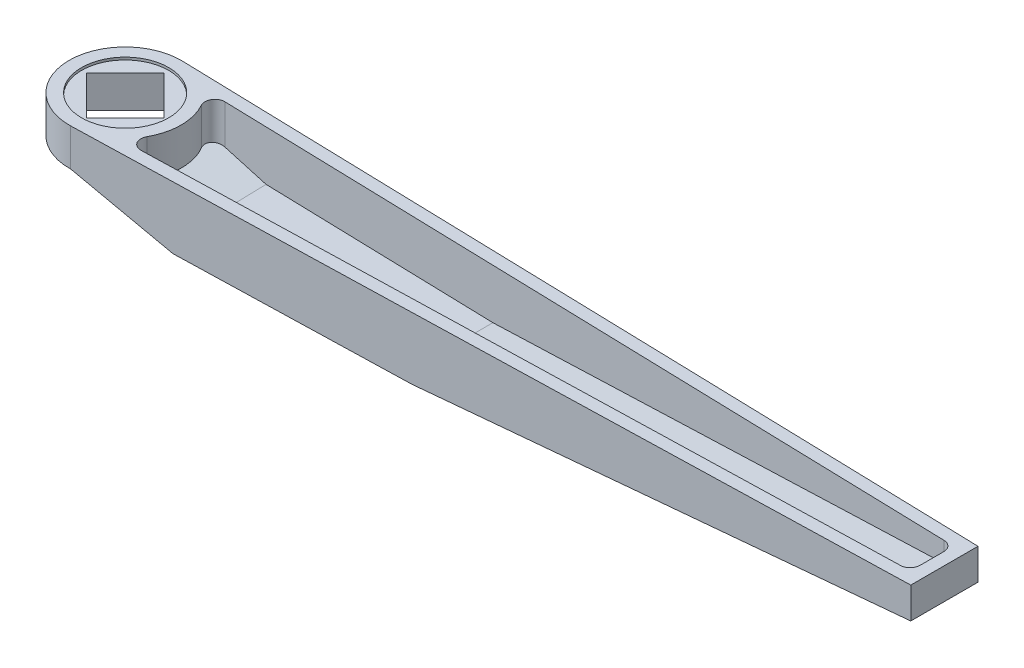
ISO-10303-21;
HEADER;
FILE_DESCRIPTION(('STEP AP214'),'2;1');
FILE_NAME('part.step','',(''),(''),'','','');
FILE_SCHEMA(('AUTOMOTIVE_DESIGN { 1 0 10303 214 1 1 1 1 }'));
ENDSEC;
DATA;
#1=APPLICATION_CONTEXT('core data for automotive mechanical design processes');
#2=APPLICATION_PROTOCOL_DEFINITION('international standard','automotive_design',2000,#1);
#3=PRODUCT_CONTEXT('',#1,'mechanical');
#4=PRODUCT('Part','Part','',(#3));
#5=PRODUCT_RELATED_PRODUCT_CATEGORY('part','',(#4));
#6=PRODUCT_DEFINITION_FORMATION('','',#4);
#7=PRODUCT_DEFINITION_CONTEXT('part definition',#1,'design');
#8=PRODUCT_DEFINITION('design','',#6,#7);
#9=PRODUCT_DEFINITION_SHAPE('','',#8);
#10=(LENGTH_UNIT() NAMED_UNIT(*) SI_UNIT(.MILLI.,.METRE.));
#11=(NAMED_UNIT(*) PLANE_ANGLE_UNIT() SI_UNIT($,.RADIAN.));
#12=(NAMED_UNIT(*) SI_UNIT($,.STERADIAN.) SOLID_ANGLE_UNIT());
#13=UNCERTAINTY_MEASURE_WITH_UNIT(LENGTH_MEASURE(1.E-05),#10,'distance_accuracy_value','');
#14=(GEOMETRIC_REPRESENTATION_CONTEXT(3) GLOBAL_UNCERTAINTY_ASSIGNED_CONTEXT((#13)) GLOBAL_UNIT_ASSIGNED_CONTEXT((#10,
#11,#12)) REPRESENTATION_CONTEXT('',''));
#15=CARTESIAN_POINT('',(0.,0.,0.));
#16=DIRECTION('',(0.,0.,1.));
#17=DIRECTION('',(1.,0.,0.));
#18=AXIS2_PLACEMENT_3D('',#15,#16,#17);
#19=CARTESIAN_POINT('',(0.615847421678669,25.,-22.4915702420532));
#20=DIRECTION('',(1.,0.,0.));
#21=DIRECTION('',(0.,0.,-1.));
#22=AXIS2_PLACEMENT_3D('',#19,#20,#21);
#23=PLANE('',#22);
#24=DIRECTION('',(0.,1.,0.));
#25=VECTOR('',#24,1.);
#26=CARTESIAN_POINT('',(0.615847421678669,0.,17.4891604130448));
#27=LINE('',#26,#25);
#28=CARTESIAN_POINT('',(0.615847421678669,9.96576976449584,17.4891604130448));
#29=VERTEX_POINT('',#28);
#30=CARTESIAN_POINT('',(0.615847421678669,10.,17.4891604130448));
#31=VERTEX_POINT('',#30);
#32=EDGE_CURVE('E229',#29,#31,#27,.T.);
#33=ORIENTED_EDGE('',*,*,#32,.F.);
#34=DIRECTION('',(0.,0.00684258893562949,0.999976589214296));
#35=VECTOR('',#34,1.);
#36=CARTESIAN_POINT('',(0.615847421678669,9.69290838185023,-22.3868276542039));
#37=LINE('',#36,#35);
#38=CARTESIAN_POINT('',(0.615847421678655,10.,22.4915702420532));
#39=VERTEX_POINT('',#38);
#40=EDGE_CURVE('E325',#29,#39,#37,.T.);
#41=ORIENTED_EDGE('',*,*,#40,.T.);
#42=DIRECTION('',(0.,0.,1.));
#43=VECTOR('',#42,1.);
#44=CARTESIAN_POINT('',(0.615847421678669,10.,-22.4915702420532));
#45=LINE('',#44,#43);
#46=EDGE_CURVE('E246',#31,#39,#45,.T.);
#47=ORIENTED_EDGE('',*,*,#46,.F.);
#48=EDGE_LOOP('',(#33,#41,#47));
#49=FACE_BOUND('',#48,.T.);
#50=ADVANCED_FACE('F61',(#49),#23,.F.);
#51=DIRECTION('',(0.,1.,0.));
#52=VECTOR('',#51,1.);
#53=CARTESIAN_POINT('',(0.615847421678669,0.,-17.4891604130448));
#54=LINE('',#53,#52);
#55=CARTESIAN_POINT('',(0.615847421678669,10.,-17.4891604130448));
#56=VERTEX_POINT('',#55);
#57=CARTESIAN_POINT('',(0.615847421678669,9.72642189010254,-17.4891604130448));
#58=VERTEX_POINT('',#57);
#59=EDGE_CURVE('E219',#56,#58,#54,.F.);
#60=ORIENTED_EDGE('',*,*,#59,.F.);
#61=CARTESIAN_POINT('',(0.615847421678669,10.,-22.4915702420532));
#62=VERTEX_POINT('',#61);
#63=EDGE_CURVE('E223',#62,#56,#45,.T.);
#64=ORIENTED_EDGE('',*,*,#63,.F.);
#65=DIRECTION('',(0.,-1.,0.));
#66=VECTOR('',#65,1.);
#67=CARTESIAN_POINT('',(0.615847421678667,25.,-22.4915702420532));
#68=LINE('',#67,#66);
#69=CARTESIAN_POINT('',(0.615847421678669,9.69219165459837,-22.4915702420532));
#70=VERTEX_POINT('',#69);
#71=EDGE_CURVE('E319',#62,#70,#68,.T.);
#72=ORIENTED_EDGE('',*,*,#71,.T.);
#73=EDGE_CURVE('E226',#70,#58,#37,.T.);
#74=ORIENTED_EDGE('',*,*,#73,.T.);
#75=EDGE_LOOP('',(#60,#64,#72,#74));
#76=FACE_BOUND('',#75,.T.);
#77=ADVANCED_FACE('F221',(#76),#23,.F.);
#78=CARTESIAN_POINT('',(11.98823269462,10.,437.826267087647));
#79=DIRECTION('',(0.242444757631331,0.970142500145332,-0.00663844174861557));
#80=DIRECTION('',(-0.970163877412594,0.242450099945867,0.));
#81=AXIS2_PLACEMENT_3D('',#78,#79,#80);
#82=PLANE('',#81);
#83=CARTESIAN_POINT('',(0.,10.,0.));
#84=DIRECTION('',(0.242444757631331,0.970142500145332,-0.00663844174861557));
#85=DIRECTION('',(-0.969779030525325,0.242535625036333,0.0265537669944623));
#86=AXIS2_PLACEMENT_3D('',#83,#84,#85);
#87=ELLIPSE('',#86,18.0385871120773,17.5);
#88=EDGE_CURVE('E454',#58,#29,#87,.F.);
#89=ORIENTED_EDGE('',*,*,#88,.F.);
#90=ORIENTED_EDGE('',*,*,#73,.F.);
#91=DIRECTION('',(0.969864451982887,-0.242193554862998,0.02655610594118));
#92=VECTOR('',#91,1.);
#93=CARTESIAN_POINT('',(-118.23205966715,39.3707689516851,-25.7457751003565));
#94=LINE('',#93,#92);
#95=CARTESIAN_POINT('',(39.4282433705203,0.,-21.4288381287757));
#96=VERTEX_POINT('',#95);
#97=EDGE_CURVE('E294',#70,#96,#94,.T.);
#98=ORIENTED_EDGE('',*,*,#97,.T.);
#99=DIRECTION('',(-0.027370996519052,0.,-0.999625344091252));
#100=VECTOR('',#99,1.);
#101=CARTESIAN_POINT('',(51.9732464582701,0.,436.731427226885));
#102=LINE('',#101,#100);
#103=CARTESIAN_POINT('',(40.6008611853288,0.,21.3967303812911));
#104=VERTEX_POINT('',#103);
#105=EDGE_CURVE('E291',#104,#96,#102,.T.);
#106=ORIENTED_EDGE('',*,*,#105,.F.);
#107=DIRECTION('',(0.969779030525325,-0.242535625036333,-0.0265537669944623));
#108=VECTOR('',#107,1.);
#109=CARTESIAN_POINT('',(-118.144121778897,39.7011200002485,25.7433672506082));
#110=LINE('',#109,#108);
#111=EDGE_CURVE('E296',#39,#104,#110,.T.);
#112=ORIENTED_EDGE('',*,*,#111,.F.);
#113=ORIENTED_EDGE('',*,*,#40,.F.);
#114=EDGE_LOOP('',(#89,#90,#98,#106,#112,#113));
#115=FACE_BOUND('',#114,.T.);
#116=ADVANCED_FACE('F460',(#115),#82,.F.);
#117=CARTESIAN_POINT('',(0.,11.,0.));
#118=DIRECTION('',(0.,-1.,0.));
#119=DIRECTION('',(0.,0.,-1.));
#120=AXIS2_PLACEMENT_3D('',#117,#118,#119);
#121=PLANE('',#120);
#122=CARTESIAN_POINT('',(0.,11.,0.));
#123=DIRECTION('',(0.,-1.,0.));
#124=DIRECTION('',(0.,0.,-1.));
#125=AXIS2_PLACEMENT_3D('',#122,#123,#124);
#126=CIRCLE('',#125,17.5);
#127=CARTESIAN_POINT('',(0.,11.,-17.5));
#128=VERTEX_POINT('',#127);
#129=EDGE_CURVE('E406',#128,#128,#126,.T.);
#130=ORIENTED_EDGE('',*,*,#129,.T.);
#131=EDGE_LOOP('',(#130));
#132=FACE_BOUND('',#131,.T.);
#133=DIRECTION('',(0.707106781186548,0.,0.707106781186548));
#134=VECTOR('',#133,1.);
#135=CARTESIAN_POINT('',(-7.77817459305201,11.,7.77817459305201));
#136=LINE('',#135,#134);
#137=CARTESIAN_POINT('',(-15.556349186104,11.,0.));
#138=VERTEX_POINT('',#137);
#139=CARTESIAN_POINT('',(0.,11.,15.556349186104));
#140=VERTEX_POINT('',#139);
#141=EDGE_CURVE('E424',#138,#140,#136,.T.);
#142=ORIENTED_EDGE('',*,*,#141,.T.);
#143=DIRECTION('',(0.707106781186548,0.,-0.707106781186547));
#144=VECTOR('',#143,1.);
#145=CARTESIAN_POINT('',(7.77817459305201,11.,7.77817459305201));
#146=LINE('',#145,#144);
#147=CARTESIAN_POINT('',(15.556349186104,11.,0.));
#148=VERTEX_POINT('',#147);
#149=EDGE_CURVE('E420',#140,#148,#146,.T.);
#150=ORIENTED_EDGE('',*,*,#149,.T.);
#151=DIRECTION('',(-0.707106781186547,0.,-0.707106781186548));
#152=VECTOR('',#151,1.);
#153=CARTESIAN_POINT('',(7.77817459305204,11.,-7.77817459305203));
#154=LINE('',#153,#152);
#155=CARTESIAN_POINT('',(0.,11.,-15.5563491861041));
#156=VERTEX_POINT('',#155);
#157=EDGE_CURVE('E430',#148,#156,#154,.T.);
#158=ORIENTED_EDGE('',*,*,#157,.T.);
#159=DIRECTION('',(-0.707106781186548,0.,0.707106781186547));
#160=VECTOR('',#159,1.);
#161=CARTESIAN_POINT('',(-7.77817459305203,11.,-7.77817459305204));
#162=LINE('',#161,#160);
#163=EDGE_CURVE('E427',#156,#138,#162,.T.);
#164=ORIENTED_EDGE('',*,*,#163,.T.);
#165=EDGE_LOOP('',(#142,#150,#158,#164));
#166=FACE_BOUND('',#165,.T.);
#167=ADVANCED_FACE('F535',(#132,#166),#121,.T.);
#168=CARTESIAN_POINT('',(0.,24.,0.));
#169=DIRECTION('',(0.,-1.,0.));
#170=DIRECTION('',(0.,0.,-1.));
#171=AXIS2_PLACEMENT_3D('',#168,#169,#170);
#172=PLANE('',#171);
#173=CARTESIAN_POINT('',(0.,24.,0.));
#174=DIRECTION('',(0.,-1.,0.));
#175=DIRECTION('',(0.,0.,-1.));
#176=AXIS2_PLACEMENT_3D('',#173,#174,#175);
#177=CIRCLE('',#176,17.5);
#178=CARTESIAN_POINT('',(0.,24.,-17.5));
#179=VERTEX_POINT('',#178);
#180=EDGE_CURVE('E411',#179,#179,#177,.T.);
#181=ORIENTED_EDGE('',*,*,#180,.F.);
#182=EDGE_LOOP('',(#181));
#183=FACE_BOUND('',#182,.T.);
#184=DIRECTION('',(-0.707106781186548,0.,0.707106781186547));
#185=VECTOR('',#184,1.);
#186=CARTESIAN_POINT('',(15.556349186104,24.,0.));
#187=LINE('',#186,#185);
#188=CARTESIAN_POINT('',(15.556349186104,24.,0.));
#189=VERTEX_POINT('',#188);
#190=CARTESIAN_POINT('',(0.,24.,15.556349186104));
#191=VERTEX_POINT('',#190);
#192=EDGE_CURVE('E451',#189,#191,#187,.T.);
#193=ORIENTED_EDGE('',*,*,#192,.T.);
#194=DIRECTION('',(-0.707106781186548,0.,-0.707106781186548));
#195=VECTOR('',#194,1.);
#196=CARTESIAN_POINT('',(-15.556349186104,24.,0.));
#197=LINE('',#196,#195);
#198=CARTESIAN_POINT('',(-15.556349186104,24.,0.));
#199=VERTEX_POINT('',#198);
#200=EDGE_CURVE('E448',#191,#199,#197,.T.);
#201=ORIENTED_EDGE('',*,*,#200,.T.);
#202=DIRECTION('',(0.707106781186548,0.,-0.707106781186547));
#203=VECTOR('',#202,1.);
#204=CARTESIAN_POINT('',(0.,24.,-15.5563491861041));
#205=LINE('',#204,#203);
#206=CARTESIAN_POINT('',(0.,24.,-15.5563491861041));
#207=VERTEX_POINT('',#206);
#208=EDGE_CURVE('E445',#199,#207,#205,.T.);
#209=ORIENTED_EDGE('',*,*,#208,.T.);
#210=DIRECTION('',(0.707106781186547,0.,0.707106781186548));
#211=VECTOR('',#210,1.);
#212=CARTESIAN_POINT('',(0.,24.,-15.5563491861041));
#213=LINE('',#212,#211);
#214=EDGE_CURVE('E442',#207,#189,#213,.T.);
#215=ORIENTED_EDGE('',*,*,#214,.T.);
#216=EDGE_LOOP('',(#193,#201,#209,#215));
#217=FACE_BOUND('',#216,.T.);
#218=ADVANCED_FACE('F631',(#183,#217),#172,.F.);
#219=CARTESIAN_POINT('',(-122.525664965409,25.,0.));
#220=DIRECTION('',(0.,1.,0.));
#221=DIRECTION('',(0.,0.,1.));
#222=AXIS2_PLACEMENT_3D('',#219,#220,#221);
#223=PLANE('',#222);
#224=CARTESIAN_POINT('',(0.,25.,0.));
#225=DIRECTION('',(0.,1.,0.));
#226=DIRECTION('',(0.,0.,1.));
#227=AXIS2_PLACEMENT_3D('',#224,#225,#226);
#228=CIRCLE('',#227,22.5);
#229=CARTESIAN_POINT('',(0.615847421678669,25.,-22.4915702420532));
#230=VERTEX_POINT('',#229);
#231=CARTESIAN_POINT('',(0.615847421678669,25.,22.4915702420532));
#232=VERTEX_POINT('',#231);
#233=EDGE_CURVE('E253',#230,#232,#228,.T.);
#234=ORIENTED_EDGE('',*,*,#233,.T.);
#235=DIRECTION('',(0.999625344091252,0.,-0.027370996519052));
#236=VECTOR('',#235,1.);
#237=CARTESIAN_POINT('',(-121.818024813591,25.,25.8439633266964));
#238=LINE('',#237,#236);
#239=CARTESIAN_POINT('',(329.,25.,13.5));
#240=VERTEX_POINT('',#239);
#241=EDGE_CURVE('E307',#232,#240,#238,.T.);
#242=ORIENTED_EDGE('',*,*,#241,.T.);
#243=DIRECTION('',(0.,0.,1.));
#244=VECTOR('',#243,1.);
#245=CARTESIAN_POINT('',(329.,25.,0.));
#246=LINE('',#245,#244);
#247=CARTESIAN_POINT('',(329.,25.,-13.5));
#248=VERTEX_POINT('',#247);
#249=EDGE_CURVE('E300',#248,#240,#246,.T.);
#250=ORIENTED_EDGE('',*,*,#249,.F.);
#251=DIRECTION('',(0.999625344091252,0.,0.027370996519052));
#252=VECTOR('',#251,1.);
#253=CARTESIAN_POINT('',(-121.818024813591,25.,-25.8439633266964));
#254=LINE('',#253,#252);
#255=EDGE_CURVE('E303',#230,#248,#254,.T.);
#256=ORIENTED_EDGE('',*,*,#255,.F.);
#257=EDGE_LOOP('',(#234,#242,#250,#256));
#258=FACE_BOUND('',#257,.T.);
#259=DIRECTION('',(0.999625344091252,0.,-0.027370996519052));
#260=VECTOR('',#259,1.);
#261=CARTESIAN_POINT('',(-121.954879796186,25.,20.8458366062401));
#262=LINE('',#261,#260);
#263=CARTESIAN_POINT('',(23.2739574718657,25.,16.869288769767));
#264=VERTEX_POINT('',#263);
#265=CARTESIAN_POINT('',(320.109483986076,25.,8.74155950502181));
#266=VERTEX_POINT('',#265);
#267=EDGE_CURVE('E277',#264,#266,#262,.T.);
#268=ORIENTED_EDGE('',*,*,#267,.F.);
#269=CARTESIAN_POINT('',(23.1644734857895,25.,12.870787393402));
#270=DIRECTION('',(0.,1.,0.));
#271=DIRECTION('',(0.,0.,1.));
#272=AXIS2_PLACEMENT_3D('',#269,#270,#271);
#273=CIRCLE('',#272,4.);
#274=CARTESIAN_POINT('',(19.6679491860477,25.,10.9280270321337));
#275=VERTEX_POINT('',#274);
#276=EDGE_CURVE('E362',#264,#275,#273,.F.);
#277=ORIENTED_EDGE('',*,*,#276,.T.);
#278=CARTESIAN_POINT('',(19.6679491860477,25.,-10.9280270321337));
#279=VERTEX_POINT('',#278);
#280=EDGE_CURVE('E398',#275,#279,#228,.T.);
#281=ORIENTED_EDGE('',*,*,#280,.T.);
#282=CARTESIAN_POINT('',(23.1644734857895,25.,-12.870787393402));
#283=DIRECTION('',(0.,1.,0.));
#284=DIRECTION('',(0.,0.,1.));
#285=AXIS2_PLACEMENT_3D('',#282,#283,#284);
#286=CIRCLE('',#285,4.);
#287=CARTESIAN_POINT('',(23.2739574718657,25.,-16.869288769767));
#288=VERTEX_POINT('',#287);
#289=EDGE_CURVE('E360',#279,#288,#286,.F.);
#290=ORIENTED_EDGE('',*,*,#289,.T.);
#291=DIRECTION('',(0.999625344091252,0.,0.027370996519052));
#292=VECTOR('',#291,1.);
#293=CARTESIAN_POINT('',(-121.954879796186,25.,-20.8458366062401));
#294=LINE('',#293,#292);
#295=CARTESIAN_POINT('',(320.109483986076,25.,-8.74155950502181));
#296=VERTEX_POINT('',#295);
#297=EDGE_CURVE('E281',#288,#296,#294,.T.);
#298=ORIENTED_EDGE('',*,*,#297,.T.);
#299=CARTESIAN_POINT('',(320.,25.,-4.7430581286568));
#300=DIRECTION('',(0.,1.,0.));
#301=DIRECTION('',(0.,0.,1.));
#302=AXIS2_PLACEMENT_3D('',#299,#300,#301);
#303=CIRCLE('',#302,4.);
#304=CARTESIAN_POINT('',(324.,25.,-4.7430581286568));
#305=VERTEX_POINT('',#304);
#306=EDGE_CURVE('E12',#296,#305,#303,.F.);
#307=ORIENTED_EDGE('',*,*,#306,.T.);
#308=DIRECTION('',(0.,0.,1.));
#309=VECTOR('',#308,1.);
#310=CARTESIAN_POINT('',(324.,25.,0.));
#311=LINE('',#310,#309);
#312=CARTESIAN_POINT('',(324.,25.,4.7430581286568));
#313=VERTEX_POINT('',#312);
#314=EDGE_CURVE('E265',#305,#313,#311,.T.);
#315=ORIENTED_EDGE('',*,*,#314,.T.);
#316=CARTESIAN_POINT('',(320.,25.,4.7430581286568));
#317=DIRECTION('',(0.,1.,0.));
#318=DIRECTION('',(0.,0.,1.));
#319=AXIS2_PLACEMENT_3D('',#316,#317,#318);
#320=CIRCLE('',#319,4.);
#321=EDGE_CURVE('E69',#313,#266,#320,.F.);
#322=ORIENTED_EDGE('',*,*,#321,.T.);
#323=EDGE_LOOP('',(#268,#277,#281,#290,#298,#307,#315,#322));
#324=FACE_BOUND('',#323,.T.);
#325=CARTESIAN_POINT('',(0.,25.,0.));
#326=DIRECTION('',(0.,-1.,0.));
#327=DIRECTION('',(0.,0.,-1.));
#328=AXIS2_PLACEMENT_3D('',#325,#326,#327);
#329=CIRCLE('',#328,17.5);
#330=CARTESIAN_POINT('',(0.,25.,-17.5));
#331=VERTEX_POINT('',#330);
#332=EDGE_CURVE('E416',#331,#331,#329,.T.);
#333=ORIENTED_EDGE('',*,*,#332,.T.);
#334=EDGE_LOOP('',(#333));
#335=FACE_BOUND('',#334,.T.);
#336=ADVANCED_FACE('F365',(#258,#324,#335),#223,.T.);
#337=CARTESIAN_POINT('',(-122.525664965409,0.,0.));
#338=DIRECTION('',(0.,1.,0.));
#339=DIRECTION('',(0.,0.,1.));
#340=AXIS2_PLACEMENT_3D('',#337,#338,#339);
#341=PLANE('',#340);
#342=DIRECTION('',(0.999625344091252,0.,0.027370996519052));
#343=VECTOR('',#342,1.);
#344=CARTESIAN_POINT('',(-121.818024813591,0.,-25.8439633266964));
#345=LINE('',#344,#343);
#346=CARTESIAN_POINT('',(134.,0.,-18.8393447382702));
#347=VERTEX_POINT('',#346);
#348=EDGE_CURVE('E299',#96,#347,#345,.T.);
#349=ORIENTED_EDGE('',*,*,#348,.T.);
#350=DIRECTION('',(0.,0.,1.));
#351=VECTOR('',#350,1.);
#352=CARTESIAN_POINT('',(134.,0.,-22.4915702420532));
#353=LINE('',#352,#351);
#354=CARTESIAN_POINT('',(134.,0.,18.8393447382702));
#355=VERTEX_POINT('',#354);
#356=EDGE_CURVE('E284',#347,#355,#353,.T.);
#357=ORIENTED_EDGE('',*,*,#356,.T.);
#358=DIRECTION('',(0.999625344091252,0.,-0.027370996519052));
#359=VECTOR('',#358,1.);
#360=CARTESIAN_POINT('',(-121.818024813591,0.,25.8439633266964));
#361=LINE('',#360,#359);
#362=EDGE_CURVE('E304',#104,#355,#361,.T.);
#363=ORIENTED_EDGE('',*,*,#362,.F.);
#364=ORIENTED_EDGE('',*,*,#105,.T.);
#365=EDGE_LOOP('',(#349,#357,#363,#364));
#366=FACE_BOUND('',#365,.T.);
#367=ADVANCED_FACE('F479',(#366),#341,.F.);
#368=CARTESIAN_POINT('',(-121.818024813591,25.,25.8439633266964));
#369=DIRECTION('',(-0.027370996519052,0.,-0.999625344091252));
#370=DIRECTION('',(-0.999625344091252,0.,0.027370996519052));
#371=AXIS2_PLACEMENT_3D('',#368,#369,#370);
#372=PLANE('',#371);
#373=ORIENTED_EDGE('',*,*,#362,.T.);
#374=DIRECTION('',(0.997579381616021,0.0639473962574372,-0.027314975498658));
#375=VECTOR('',#374,1.);
#376=CARTESIAN_POINT('',(-119.177100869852,-16.229301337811,25.7716515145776));
#377=LINE('',#376,#375);
#378=CARTESIAN_POINT('',(329.,12.5,13.5));
#379=VERTEX_POINT('',#378);
#380=EDGE_CURVE('E287',#355,#379,#377,.T.);
#381=ORIENTED_EDGE('',*,*,#380,.T.);
#382=DIRECTION('',(0.,-1.,0.));
#383=VECTOR('',#382,1.);
#384=CARTESIAN_POINT('',(329.,25.,13.5));
#385=LINE('',#384,#383);
#386=EDGE_CURVE('E309',#240,#379,#385,.T.);
#387=ORIENTED_EDGE('',*,*,#386,.F.);
#388=ORIENTED_EDGE('',*,*,#241,.F.);
#389=DIRECTION('',(0.,-1.,0.));
#390=VECTOR('',#389,1.);
#391=CARTESIAN_POINT('',(0.615847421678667,25.,22.4915702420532));
#392=LINE('',#391,#390);
#393=EDGE_CURVE('E316',#232,#39,#392,.T.);
#394=ORIENTED_EDGE('',*,*,#393,.T.);
#395=ORIENTED_EDGE('',*,*,#111,.T.);
#396=EDGE_LOOP('',(#373,#381,#387,#388,#394,#395));
#397=FACE_BOUND('',#396,.T.);
#398=ADVANCED_FACE('F463',(#397),#372,.F.);
#399=CARTESIAN_POINT('',(329.,25.,0.));
#400=DIRECTION('',(1.,0.,0.));
#401=DIRECTION('',(0.,0.,-1.));
#402=AXIS2_PLACEMENT_3D('',#399,#400,#401);
#403=PLANE('',#402);
#404=DIRECTION('',(0.,0.,1.));
#405=VECTOR('',#404,1.);
#406=CARTESIAN_POINT('',(329.,12.5,-22.4915702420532));
#407=LINE('',#406,#405);
#408=CARTESIAN_POINT('',(329.,12.5,-13.5));
#409=VERTEX_POINT('',#408);
#410=EDGE_CURVE('E276',#409,#379,#407,.T.);
#411=ORIENTED_EDGE('',*,*,#410,.F.);
#412=DIRECTION('',(0.,-1.,0.));
#413=VECTOR('',#412,1.);
#414=CARTESIAN_POINT('',(329.,25.,-13.5));
#415=LINE('',#414,#413);
#416=EDGE_CURVE('E322',#248,#409,#415,.T.);
#417=ORIENTED_EDGE('',*,*,#416,.F.);
#418=ORIENTED_EDGE('',*,*,#249,.T.);
#419=ORIENTED_EDGE('',*,*,#386,.T.);
#420=EDGE_LOOP('',(#411,#417,#418,#419));
#421=FACE_BOUND('',#420,.T.);
#422=ADVANCED_FACE('F475',(#421),#403,.T.);
#423=CARTESIAN_POINT('',(-121.818024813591,25.,-25.8439633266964));
#424=DIRECTION('',(0.027370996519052,0.,-0.999625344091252));
#425=DIRECTION('',(-0.999625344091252,0.,-0.027370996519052));
#426=AXIS2_PLACEMENT_3D('',#423,#424,#425);
#427=PLANE('',#426);
#428=DIRECTION('',(0.997579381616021,0.0639473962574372,0.027314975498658));
#429=VECTOR('',#428,1.);
#430=CARTESIAN_POINT('',(-119.177100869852,-16.229301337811,-25.7716515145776));
#431=LINE('',#430,#429);
#432=EDGE_CURVE('E327',#347,#409,#431,.T.);
#433=ORIENTED_EDGE('',*,*,#432,.F.);
#434=ORIENTED_EDGE('',*,*,#348,.F.);
#435=ORIENTED_EDGE('',*,*,#97,.F.);
#436=ORIENTED_EDGE('',*,*,#71,.F.);
#437=EDGE_CURVE('E320',#230,#62,#68,.T.);
#438=ORIENTED_EDGE('',*,*,#437,.F.);
#439=ORIENTED_EDGE('',*,*,#255,.T.);
#440=ORIENTED_EDGE('',*,*,#416,.T.);
#441=EDGE_LOOP('',(#433,#434,#435,#436,#438,#439,#440));
#442=FACE_BOUND('',#441,.T.);
#443=ADVANCED_FACE('F470',(#442),#427,.T.);
#444=CARTESIAN_POINT('',(329.,12.5,-22.4915702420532));
#445=DIRECTION('',(-0.063971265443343,0.997951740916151,0.));
#446=DIRECTION('',(-0.997951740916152,-0.063971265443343,0.));
#447=AXIS2_PLACEMENT_3D('',#444,#445,#446);
#448=PLANE('',#447);
#449=ORIENTED_EDGE('',*,*,#356,.F.);
#450=ORIENTED_EDGE('',*,*,#432,.T.);
#451=ORIENTED_EDGE('',*,*,#410,.T.);
#452=ORIENTED_EDGE('',*,*,#380,.F.);
#453=EDGE_LOOP('',(#449,#450,#451,#452));
#454=FACE_BOUND('',#453,.T.);
#455=ADVANCED_FACE('F480',(#454),#448,.F.);
#456=CARTESIAN_POINT('',(-122.525664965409,5.,0.));
#457=DIRECTION('',(0.,1.,0.));
#458=DIRECTION('',(0.,0.,1.));
#459=AXIS2_PLACEMENT_3D('',#456,#457,#458);
#460=PLANE('',#459);
#461=DIRECTION('',(0.999625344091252,0.,0.027370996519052));
#462=VECTOR('',#461,1.);
#463=CARTESIAN_POINT('',(-121.954879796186,5.,-20.8458366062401));
#464=LINE('',#463,#462);
#465=CARTESIAN_POINT('',(40.1815245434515,5.,-16.4063383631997));
#466=VERTEX_POINT('',#465);
#467=CARTESIAN_POINT('',(133.839907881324,5.,-13.841854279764));
#468=VERTEX_POINT('',#467);
#469=EDGE_CURVE('E255',#466,#468,#464,.T.);
#470=ORIENTED_EDGE('',*,*,#469,.F.);
#471=DIRECTION('',(-0.027370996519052,0.,-0.999625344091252));
#472=VECTOR('',#471,1.);
#473=CARTESIAN_POINT('',(40.5085185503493,5.,-4.46408056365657));
#474=LINE('',#473,#472);
#475=CARTESIAN_POINT('',(41.0793037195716,5.,16.3817560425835));
#476=VERTEX_POINT('',#475);
#477=EDGE_CURVE('E266',#476,#466,#474,.T.);
#478=ORIENTED_EDGE('',*,*,#477,.F.);
#479=DIRECTION('',(0.999625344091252,0.,-0.027370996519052));
#480=VECTOR('',#479,1.);
#481=CARTESIAN_POINT('',(-121.954879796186,5.,20.8458366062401));
#482=LINE('',#481,#480);
#483=CARTESIAN_POINT('',(133.839907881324,5.,13.841854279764));
#484=VERTEX_POINT('',#483);
#485=EDGE_CURVE('E258',#476,#484,#482,.T.);
#486=ORIENTED_EDGE('',*,*,#485,.T.);
#487=DIRECTION('',(0.,0.,1.));
#488=VECTOR('',#487,1.);
#489=CARTESIAN_POINT('',(133.839907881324,5.,0.));
#490=LINE('',#489,#488);
#491=EDGE_CURVE('E248',#468,#484,#490,.T.);
#492=ORIENTED_EDGE('',*,*,#491,.F.);
#493=EDGE_LOOP('',(#470,#478,#486,#492));
#494=FACE_BOUND('',#493,.T.);
#495=ADVANCED_FACE('F390',(#494),#460,.T.);
#496=CARTESIAN_POINT('',(-121.954879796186,25.,20.8458366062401));
#497=DIRECTION('',(-0.027370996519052,0.,-0.999625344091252));
#498=DIRECTION('',(-0.999625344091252,0.,0.027370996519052));
#499=AXIS2_PLACEMENT_3D('',#496,#497,#498);
#500=PLANE('',#499);
#501=DIRECTION('',(0.969779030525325,-0.242535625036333,-0.0265537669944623));
#502=VECTOR('',#501,1.);
#503=CARTESIAN_POINT('',(-117.068752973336,44.5518325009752,20.7120483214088));
#504=LINE('',#503,#502);
#505=CARTESIAN_POINT('',(23.2739574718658,9.45300490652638,16.869288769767));
#506=VERTEX_POINT('',#505);
#507=EDGE_CURVE('E259',#506,#476,#504,.T.);
#508=ORIENTED_EDGE('',*,*,#507,.F.);
#509=DIRECTION('',(0.,-1.,0.));
#510=VECTOR('',#509,1.);
#511=CARTESIAN_POINT('',(23.2739574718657,25.,16.869288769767));
#512=LINE('',#511,#510);
#513=EDGE_CURVE('E350',#506,#264,#512,.F.);
#514=ORIENTED_EDGE('',*,*,#513,.T.);
#515=ORIENTED_EDGE('',*,*,#267,.T.);
#516=DIRECTION('',(0.,-1.,0.));
#517=VECTOR('',#516,1.);
#518=CARTESIAN_POINT('',(320.109483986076,25.,8.74155950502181));
#519=LINE('',#518,#517);
#520=CARTESIAN_POINT('',(320.109483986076,16.9403574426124,8.74155950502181));
#521=VERTEX_POINT('',#520);
#522=EDGE_CURVE('E347',#266,#521,#519,.T.);
#523=ORIENTED_EDGE('',*,*,#522,.T.);
#524=DIRECTION('',(0.997579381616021,0.0639473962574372,-0.027314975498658));
#525=VECTOR('',#524,1.);
#526=CARTESIAN_POINT('',(-119.633013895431,-11.2482642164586,20.7822610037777));
#527=LINE('',#526,#525);
#528=EDGE_CURVE('E262',#484,#521,#527,.T.);
#529=ORIENTED_EDGE('',*,*,#528,.F.);
#530=ORIENTED_EDGE('',*,*,#485,.F.);
#531=EDGE_LOOP('',(#508,#514,#515,#523,#529,#530));
#532=FACE_BOUND('',#531,.T.);
#533=ADVANCED_FACE('F372',(#532),#500,.T.);
#534=CARTESIAN_POINT('',(324.,25.,0.));
#535=DIRECTION('',(1.,0.,0.));
#536=DIRECTION('',(0.,0.,-1.));
#537=AXIS2_PLACEMENT_3D('',#534,#535,#536);
#538=PLANE('',#537);
#539=DIRECTION('',(0.,0.,1.));
#540=VECTOR('',#539,1.);
#541=CARTESIAN_POINT('',(324.,17.189749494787,0.));
#542=LINE('',#541,#540);
#543=CARTESIAN_POINT('',(324.,17.189749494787,-4.7430581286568));
#544=VERTEX_POINT('',#543);
#545=CARTESIAN_POINT('',(324.,17.189749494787,4.7430581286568));
#546=VERTEX_POINT('',#545);
#547=EDGE_CURVE('E245',#544,#546,#542,.T.);
#548=ORIENTED_EDGE('',*,*,#547,.T.);
#549=DIRECTION('',(0.,-1.,0.));
#550=VECTOR('',#549,1.);
#551=CARTESIAN_POINT('',(324.,25.,4.7430581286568));
#552=LINE('',#551,#550);
#553=EDGE_CURVE('E76',#546,#313,#552,.F.);
#554=ORIENTED_EDGE('',*,*,#553,.T.);
#555=ORIENTED_EDGE('',*,*,#314,.F.);
#556=DIRECTION('',(0.,-1.,0.));
#557=VECTOR('',#556,1.);
#558=CARTESIAN_POINT('',(324.,17.189749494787,-4.7430581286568));
#559=LINE('',#558,#557);
#560=EDGE_CURVE('E356',#305,#544,#559,.T.);
#561=ORIENTED_EDGE('',*,*,#560,.T.);
#562=EDGE_LOOP('',(#548,#554,#555,#561));
#563=FACE_BOUND('',#562,.T.);
#564=ADVANCED_FACE('F378',(#563),#538,.F.);
#565=CARTESIAN_POINT('',(-121.954879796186,25.,-20.8458366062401));
#566=DIRECTION('',(0.027370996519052,0.,-0.999625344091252));
#567=DIRECTION('',(-0.999625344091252,0.,-0.027370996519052));
#568=AXIS2_PLACEMENT_3D('',#565,#566,#567);
#569=PLANE('',#568);
#570=ORIENTED_EDGE('',*,*,#297,.F.);
#571=DIRECTION('',(0.,1.,0.));
#572=VECTOR('',#571,1.);
#573=CARTESIAN_POINT('',(23.2739574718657,25.,-16.869288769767));
#574=LINE('',#573,#572);
#575=CARTESIAN_POINT('',(23.2739574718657,9.22214028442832,-16.869288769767));
#576=VERTEX_POINT('',#575);
#577=EDGE_CURVE('E335',#288,#576,#574,.F.);
#578=ORIENTED_EDGE('',*,*,#577,.T.);
#579=DIRECTION('',(0.969864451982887,-0.242193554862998,0.02655610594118));
#580=VECTOR('',#579,1.);
#581=CARTESIAN_POINT('',(-117.142226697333,44.2867255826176,-20.7140601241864));
#582=LINE('',#581,#580);
#583=EDGE_CURVE('E269',#576,#466,#582,.T.);
#584=ORIENTED_EDGE('',*,*,#583,.T.);
#585=ORIENTED_EDGE('',*,*,#469,.T.);
#586=DIRECTION('',(0.997579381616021,0.0639473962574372,0.027314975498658));
#587=VECTOR('',#586,1.);
#588=CARTESIAN_POINT('',(-119.633013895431,-11.2482642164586,-20.7822610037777));
#589=LINE('',#588,#587);
#590=CARTESIAN_POINT('',(320.109483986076,16.9403574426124,-8.74155950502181));
#591=VERTEX_POINT('',#590);
#592=EDGE_CURVE('E273',#468,#591,#589,.T.);
#593=ORIENTED_EDGE('',*,*,#592,.T.);
#594=DIRECTION('',(0.,-1.,0.));
#595=VECTOR('',#594,1.);
#596=CARTESIAN_POINT('',(320.109483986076,25.,-8.74155950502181));
#597=LINE('',#596,#595);
#598=EDGE_CURVE('E238',#591,#296,#597,.F.);
#599=ORIENTED_EDGE('',*,*,#598,.T.);
#600=EDGE_LOOP('',(#570,#578,#584,#585,#593,#599));
#601=FACE_BOUND('',#600,.T.);
#602=ADVANCED_FACE('F385',(#601),#569,.F.);
#603=CARTESIAN_POINT('',(13.2004564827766,14.8507125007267,437.793074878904));
#604=DIRECTION('',(0.242444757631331,0.970142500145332,-0.00663844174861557));
#605=DIRECTION('',(-0.970163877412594,0.242450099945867,0.));
#606=AXIS2_PLACEMENT_3D('',#603,#604,#605);
#607=PLANE('',#606);
#608=ORIENTED_EDGE('',*,*,#583,.F.);
#609=CARTESIAN_POINT('',(23.1644734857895,9.27686176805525,-12.870787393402));
#610=DIRECTION('',(0.242444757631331,0.970142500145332,-0.00663844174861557));
#611=DIRECTION('',(-0.969779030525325,0.242535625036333,0.0265537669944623));
#612=AXIS2_PLACEMENT_3D('',#609,#610,#611);
#613=ELLIPSE('',#612,4.12310562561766,4.);
#614=CARTESIAN_POINT('',(19.6679491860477,10.1639591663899,-10.9280270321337));
#615=VERTEX_POINT('',#614);
#616=EDGE_CURVE('E340',#576,#615,#613,.T.);
#617=ORIENTED_EDGE('',*,*,#616,.T.);
#618=CARTESIAN_POINT('',(0.,15.1538820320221,0.));
#619=DIRECTION('',(0.242444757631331,0.970142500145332,-0.00663844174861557));
#620=DIRECTION('',(-0.969779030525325,0.242535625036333,0.0265537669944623));
#621=AXIS2_PLACEMENT_3D('',#618,#619,#620);
#622=ELLIPSE('',#621,23.1924691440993,22.5);
#623=CARTESIAN_POINT('',(20.3610855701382,10.,-9.5747686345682));
#624=VERTEX_POINT('',#623);
#625=EDGE_CURVE('E239',#624,#615,#622,.T.);
#626=ORIENTED_EDGE('',*,*,#625,.F.);
#627=DIRECTION('',(0.027370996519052,0.,0.999625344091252));
#628=VECTOR('',#627,1.);
#629=CARTESIAN_POINT('',(32.5960370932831,10.,437.261999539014));
#630=LINE('',#629,#628);
#631=CARTESIAN_POINT('',(20.8545232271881,10.,8.44623353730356));
#632=VERTEX_POINT('',#631);
#633=EDGE_CURVE('E329',#624,#632,#630,.T.);
#634=ORIENTED_EDGE('',*,*,#633,.T.);
#635=CARTESIAN_POINT('',(19.6679491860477,10.3135146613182,10.9280270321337));
#636=VERTEX_POINT('',#635);
#637=EDGE_CURVE('E332',#636,#632,#622,.T.);
#638=ORIENTED_EDGE('',*,*,#637,.F.);
#639=CARTESIAN_POINT('',(23.1644734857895,9.45300490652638,12.870787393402));
#640=DIRECTION('',(0.242444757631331,0.970142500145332,-0.00663844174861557));
#641=DIRECTION('',(-0.969779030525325,0.242535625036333,0.0265537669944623));
#642=AXIS2_PLACEMENT_3D('',#639,#640,#641);
#643=ELLIPSE('',#642,4.12310562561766,4.);
#644=EDGE_CURVE('E338',#636,#506,#643,.T.);
#645=ORIENTED_EDGE('',*,*,#644,.T.);
#646=ORIENTED_EDGE('',*,*,#507,.T.);
#647=ORIENTED_EDGE('',*,*,#477,.T.);
#648=EDGE_LOOP('',(#608,#617,#626,#634,#638,#645,#646,#647));
#649=FACE_BOUND('',#648,.T.);
#650=ADVANCED_FACE('F676',(#649),#607,.T.);
#651=CARTESIAN_POINT('',(328.680143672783,17.4897587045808,-22.4915702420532));
#652=DIRECTION('',(-0.063971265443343,0.997951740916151,0.));
#653=DIRECTION('',(-0.997951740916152,-0.063971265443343,0.));
#654=AXIS2_PLACEMENT_3D('',#651,#652,#653);
#655=PLANE('',#654);
#656=ORIENTED_EDGE('',*,*,#528,.T.);
#657=CARTESIAN_POINT('',(320.,16.9333392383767,4.7430581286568));
#658=DIRECTION('',(-0.063971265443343,0.997951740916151,0.));
#659=DIRECTION('',(-0.997951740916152,-0.063971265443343,0.));
#660=AXIS2_PLACEMENT_3D('',#657,#658,#659);
#661=ELLIPSE('',#660,4.00820985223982,4.);
#662=EDGE_CURVE('E354',#521,#546,#661,.T.);
#663=ORIENTED_EDGE('',*,*,#662,.T.);
#664=ORIENTED_EDGE('',*,*,#547,.F.);
#665=CARTESIAN_POINT('',(320.,16.9333392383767,-4.7430581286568));
#666=DIRECTION('',(-0.063971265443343,0.997951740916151,0.));
#667=DIRECTION('',(0.997951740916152,0.063971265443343,0.));
#668=AXIS2_PLACEMENT_3D('',#665,#666,#667);
#669=ELLIPSE('',#668,4.00820985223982,4.);
#670=EDGE_CURVE('E352',#544,#591,#669,.T.);
#671=ORIENTED_EDGE('',*,*,#670,.T.);
#672=ORIENTED_EDGE('',*,*,#592,.F.);
#673=ORIENTED_EDGE('',*,*,#491,.T.);
#674=EDGE_LOOP('',(#656,#663,#664,#671,#672,#673));
#675=FACE_BOUND('',#674,.T.);
#676=ADVANCED_FACE('F377',(#675),#655,.T.);
#677=CARTESIAN_POINT('',(0.,10.,0.));
#678=DIRECTION('',(0.,1.,0.));
#679=DIRECTION('',(0.,0.,1.));
#680=AXIS2_PLACEMENT_3D('',#677,#678,#679);
#681=CYLINDRICAL_SURFACE('',#680,22.5);
#682=CARTESIAN_POINT('',(0.,10.,0.));
#683=DIRECTION('',(0.,1.,0.));
#684=DIRECTION('',(0.,0.,1.));
#685=AXIS2_PLACEMENT_3D('',#682,#683,#684);
#686=CIRCLE('',#685,22.5);
#687=EDGE_CURVE('E244',#62,#39,#686,.T.);
#688=ORIENTED_EDGE('',*,*,#687,.T.);
#689=ORIENTED_EDGE('',*,*,#393,.F.);
#690=ORIENTED_EDGE('',*,*,#233,.F.);
#691=ORIENTED_EDGE('',*,*,#437,.T.);
#692=EDGE_LOOP('',(#688,#689,#690,#691));
#693=FACE_BOUND('',#692,.T.);
#694=ADVANCED_FACE('F466',(#693),#681,.T.);
#695=ORIENTED_EDGE('',*,*,#625,.T.);
#696=DIRECTION('',(0.,1.,0.));
#697=VECTOR('',#696,1.);
#698=CARTESIAN_POINT('',(19.6679491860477,10.,-10.9280270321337));
#699=LINE('',#698,#697);
#700=EDGE_CURVE('E345',#615,#279,#699,.T.);
#701=ORIENTED_EDGE('',*,*,#700,.T.);
#702=ORIENTED_EDGE('',*,*,#280,.F.);
#703=DIRECTION('',(0.,1.,0.));
#704=VECTOR('',#703,1.);
#705=CARTESIAN_POINT('',(19.6679491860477,10.,10.9280270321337));
#706=LINE('',#705,#704);
#707=EDGE_CURVE('E342',#275,#636,#706,.F.);
#708=ORIENTED_EDGE('',*,*,#707,.T.);
#709=ORIENTED_EDGE('',*,*,#637,.T.);
#710=EDGE_CURVE('E250',#632,#624,#686,.T.);
#711=ORIENTED_EDGE('',*,*,#710,.T.);
#712=EDGE_LOOP('',(#695,#701,#702,#708,#709,#711));
#713=FACE_BOUND('',#712,.T.);
#714=ADVANCED_FACE('F402',(#713),#681,.T.);
#715=CARTESIAN_POINT('',(0.,10.,0.));
#716=DIRECTION('',(0.,1.,0.));
#717=DIRECTION('',(0.,0.,1.));
#718=AXIS2_PLACEMENT_3D('',#715,#716,#717);
#719=PLANE('',#718);
#720=ORIENTED_EDGE('',*,*,#63,.T.);
#721=CARTESIAN_POINT('',(0.,10.,0.));
#722=DIRECTION('',(0.,1.,0.));
#723=DIRECTION('',(0.,0.,1.));
#724=AXIS2_PLACEMENT_3D('',#721,#722,#723);
#725=CIRCLE('',#724,17.5);
#726=EDGE_CURVE('E232',#56,#31,#725,.T.);
#727=ORIENTED_EDGE('',*,*,#726,.T.);
#728=ORIENTED_EDGE('',*,*,#46,.T.);
#729=ORIENTED_EDGE('',*,*,#687,.F.);
#730=EDGE_LOOP('',(#720,#727,#728,#729));
#731=FACE_BOUND('',#730,.T.);
#732=ADVANCED_FACE('F242',(#731),#719,.F.);
#733=ORIENTED_EDGE('',*,*,#633,.F.);
#734=ORIENTED_EDGE('',*,*,#710,.F.);
#735=EDGE_LOOP('',(#733,#734));
#736=FACE_BOUND('',#735,.T.);
#737=ADVANCED_FACE('F544',(#736),#719,.F.);
#738=CARTESIAN_POINT('',(0.,11.,0.));
#739=DIRECTION('',(0.,-1.,0.));
#740=DIRECTION('',(0.,0.,-1.));
#741=AXIS2_PLACEMENT_3D('',#738,#739,#740);
#742=CYLINDRICAL_SURFACE('',#741,17.5);
#743=ORIENTED_EDGE('',*,*,#129,.F.);
#744=EDGE_LOOP('',(#743));
#745=FACE_BOUND('',#744,.T.);
#746=ORIENTED_EDGE('',*,*,#726,.F.);
#747=ORIENTED_EDGE('',*,*,#59,.T.);
#748=ORIENTED_EDGE('',*,*,#88,.T.);
#749=ORIENTED_EDGE('',*,*,#32,.T.);
#750=EDGE_LOOP('',(#746,#747,#748,#749));
#751=FACE_BOUND('',#750,.T.);
#752=ADVANCED_FACE('F233',(#745,#751),#742,.F.);
#753=CARTESIAN_POINT('',(0.,24.,0.));
#754=DIRECTION('',(0.,1.,0.));
#755=DIRECTION('',(0.,0.,1.));
#756=AXIS2_PLACEMENT_3D('',#753,#754,#755);
#757=CYLINDRICAL_SURFACE('',#756,17.5);
#758=ORIENTED_EDGE('',*,*,#180,.T.);
#759=EDGE_LOOP('',(#758));
#760=FACE_BOUND('',#759,.T.);
#761=ORIENTED_EDGE('',*,*,#332,.F.);
#762=EDGE_LOOP('',(#761));
#763=FACE_BOUND('',#762,.T.);
#764=ADVANCED_FACE('F555',(#760,#763),#757,.F.);
#765=CARTESIAN_POINT('',(0.,0.,-15.5563491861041));
#766=DIRECTION('',(-0.707106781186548,0.,0.707106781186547));
#767=DIRECTION('',(0.707106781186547,0.,0.707106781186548));
#768=AXIS2_PLACEMENT_3D('',#765,#766,#767);
#769=PLANE('',#768);
#770=DIRECTION('',(0.,1.,0.));
#771=VECTOR('',#770,1.);
#772=CARTESIAN_POINT('',(15.556349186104,0.,0.));
#773=LINE('',#772,#771);
#774=EDGE_CURVE('E439',#148,#189,#773,.T.);
#775=ORIENTED_EDGE('',*,*,#774,.T.);
#776=ORIENTED_EDGE('',*,*,#214,.F.);
#777=DIRECTION('',(0.,1.,0.));
#778=VECTOR('',#777,1.);
#779=CARTESIAN_POINT('',(0.,0.,-15.5563491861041));
#780=LINE('',#779,#778);
#781=EDGE_CURVE('E437',#156,#207,#780,.T.);
#782=ORIENTED_EDGE('',*,*,#781,.F.);
#783=ORIENTED_EDGE('',*,*,#157,.F.);
#784=EDGE_LOOP('',(#775,#776,#782,#783));
#785=FACE_BOUND('',#784,.T.);
#786=ADVANCED_FACE('F568',(#785),#769,.T.);
#787=CARTESIAN_POINT('',(0.,0.,-15.5563491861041));
#788=DIRECTION('',(0.707106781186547,0.,0.707106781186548));
#789=DIRECTION('',(0.707106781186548,0.,-0.707106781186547));
#790=AXIS2_PLACEMENT_3D('',#787,#788,#789);
#791=PLANE('',#790);
#792=ORIENTED_EDGE('',*,*,#781,.T.);
#793=ORIENTED_EDGE('',*,*,#208,.F.);
#794=DIRECTION('',(0.,1.,0.));
#795=VECTOR('',#794,1.);
#796=CARTESIAN_POINT('',(-15.556349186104,0.,0.));
#797=LINE('',#796,#795);
#798=EDGE_CURVE('E435',#138,#199,#797,.T.);
#799=ORIENTED_EDGE('',*,*,#798,.F.);
#800=ORIENTED_EDGE('',*,*,#163,.F.);
#801=EDGE_LOOP('',(#792,#793,#799,#800));
#802=FACE_BOUND('',#801,.T.);
#803=ADVANCED_FACE('F577',(#802),#791,.T.);
#804=CARTESIAN_POINT('',(-15.556349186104,0.,0.));
#805=DIRECTION('',(0.707106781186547,0.,-0.707106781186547));
#806=DIRECTION('',(-0.707106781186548,0.,-0.707106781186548));
#807=AXIS2_PLACEMENT_3D('',#804,#805,#806);
#808=PLANE('',#807);
#809=ORIENTED_EDGE('',*,*,#798,.T.);
#810=ORIENTED_EDGE('',*,*,#200,.F.);
#811=DIRECTION('',(0.,1.,0.));
#812=VECTOR('',#811,1.);
#813=CARTESIAN_POINT('',(0.,0.,15.556349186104));
#814=LINE('',#813,#812);
#815=EDGE_CURVE('E433',#140,#191,#814,.T.);
#816=ORIENTED_EDGE('',*,*,#815,.F.);
#817=ORIENTED_EDGE('',*,*,#141,.F.);
#818=EDGE_LOOP('',(#809,#810,#816,#817));
#819=FACE_BOUND('',#818,.T.);
#820=ADVANCED_FACE('F586',(#819),#808,.T.);
#821=CARTESIAN_POINT('',(15.556349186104,0.,0.));
#822=DIRECTION('',(-0.707106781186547,0.,-0.707106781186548));
#823=DIRECTION('',(-0.707106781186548,0.,0.707106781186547));
#824=AXIS2_PLACEMENT_3D('',#821,#822,#823);
#825=PLANE('',#824);
#826=ORIENTED_EDGE('',*,*,#815,.T.);
#827=ORIENTED_EDGE('',*,*,#192,.F.);
#828=ORIENTED_EDGE('',*,*,#774,.F.);
#829=ORIENTED_EDGE('',*,*,#149,.F.);
#830=EDGE_LOOP('',(#826,#827,#828,#829));
#831=FACE_BOUND('',#830,.T.);
#832=ADVANCED_FACE('F503',(#831),#825,.T.);
#833=CARTESIAN_POINT('',(23.1644734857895,10.,-12.870787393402));
#834=DIRECTION('',(0.,1.,0.));
#835=DIRECTION('',(0.,0.,1.));
#836=AXIS2_PLACEMENT_3D('',#833,#834,#835);
#837=CYLINDRICAL_SURFACE('',#836,4.);
#838=ORIENTED_EDGE('',*,*,#289,.F.);
#839=ORIENTED_EDGE('',*,*,#700,.F.);
#840=ORIENTED_EDGE('',*,*,#616,.F.);
#841=ORIENTED_EDGE('',*,*,#577,.F.);
#842=EDGE_LOOP('',(#838,#839,#840,#841));
#843=FACE_BOUND('',#842,.T.);
#844=ADVANCED_FACE('F500',(#843),#837,.F.);
#845=CARTESIAN_POINT('',(23.1644734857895,10.,12.870787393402));
#846=DIRECTION('',(0.,1.,0.));
#847=DIRECTION('',(0.,0.,1.));
#848=AXIS2_PLACEMENT_3D('',#845,#846,#847);
#849=CYLINDRICAL_SURFACE('',#848,4.);
#850=ORIENTED_EDGE('',*,*,#276,.F.);
#851=ORIENTED_EDGE('',*,*,#513,.F.);
#852=ORIENTED_EDGE('',*,*,#644,.F.);
#853=ORIENTED_EDGE('',*,*,#707,.F.);
#854=EDGE_LOOP('',(#850,#851,#852,#853));
#855=FACE_BOUND('',#854,.T.);
#856=ADVANCED_FACE('F394',(#855),#849,.F.);
#857=CARTESIAN_POINT('',(320.,25.,4.7430581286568));
#858=DIRECTION('',(0.,-1.,0.));
#859=DIRECTION('',(0.,0.,-1.));
#860=AXIS2_PLACEMENT_3D('',#857,#858,#859);
#861=CYLINDRICAL_SURFACE('',#860,4.);
#862=ORIENTED_EDGE('',*,*,#321,.F.);
#863=ORIENTED_EDGE('',*,*,#553,.F.);
#864=ORIENTED_EDGE('',*,*,#662,.F.);
#865=ORIENTED_EDGE('',*,*,#522,.F.);
#866=EDGE_LOOP('',(#862,#863,#864,#865));
#867=FACE_BOUND('',#866,.T.);
#868=ADVANCED_FACE('F374',(#867),#861,.F.);
#869=CARTESIAN_POINT('',(320.,25.,-4.7430581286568));
#870=DIRECTION('',(0.,1.,0.));
#871=DIRECTION('',(0.,0.,1.));
#872=AXIS2_PLACEMENT_3D('',#869,#870,#871);
#873=CYLINDRICAL_SURFACE('',#872,4.);
#874=ORIENTED_EDGE('',*,*,#306,.F.);
#875=ORIENTED_EDGE('',*,*,#598,.F.);
#876=ORIENTED_EDGE('',*,*,#670,.F.);
#877=ORIENTED_EDGE('',*,*,#560,.F.);
#878=EDGE_LOOP('',(#874,#875,#876,#877));
#879=FACE_BOUND('',#878,.T.);
#880=ADVANCED_FACE('F63',(#879),#873,.F.);
#881=CLOSED_SHELL('',(#50,#77,#116,#167,#218,#336,#367,#398,#422,#443,#455,#495,#533,#564,#602,
#650,#676,#694,#714,#732,#737,#752,#764,#786,#803,#820,#832,#844,#856,#868,#880));
#882=MANIFOLD_SOLID_BREP('B2',#881);
#883=ADVANCED_BREP_SHAPE_REPRESENTATION('',(#18,#882),#14);
#884=SHAPE_DEFINITION_REPRESENTATION(#9,#883);
ENDSEC;
END-ISO-10303-21;
